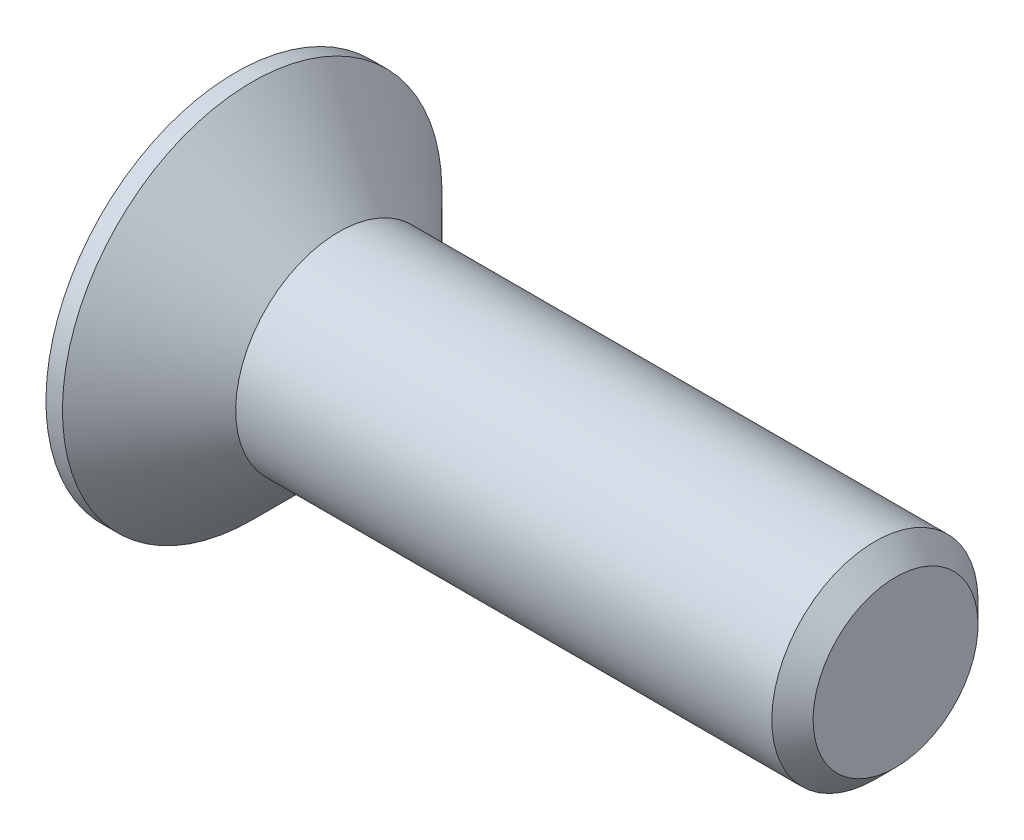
from build123d import *

# Parameters (mm, degrees)
CHAMFER1_SIZE      = 0.5
CUT_EXTRUDE1_DEPTH = 2.1


with BuildPart() as part:
    # Sketch1 → Revolve1 (revolve)
    with BuildSketch(Plane.XY, mode=Mode.PRIVATE) as revolve1_sk:
        Polygon((-2.5, 4.6), (-2.5, 0), (13.5, 0), (13.5, 2.5), (0, 2.5), (-2.1, 4.6), align=None)
    revolve(revolve1_sk.sketch.rotate(Axis((-2.5, 0, 0), (1, 0, 0)), 180), axis=Axis((-2.5, 0, 0), (1, 0, 0)))

    # Chamfer1
    chamfer1_edges = [part.edges().sort_by_distance(p)[0] for p in [
        (13.5, 2.5, 0),
    ]]
    chamfer(chamfer1_edges, length=CHAMFER1_SIZE)

    # Sketch2 → Cut-Extrude1 (cut)
    with BuildSketch(Plane.ZY.offset(2.5)):
        Polygon((-0.575, 2.3), (0.575, 2.3), (0.575, 0.575), (2.3, 0.575), (2.3, -0.575), (0.575, -0.575), (0.575, -2.3), (-0.575, -2.3), (-0.575, -0.575), (-2.3, -0.575), (-2.3, 0.575), (-0.575, 0.575), align=None)
    extrude(amount=-CUT_EXTRUDE1_DEPTH, mode=Mode.SUBTRACT)


solid = part.part
